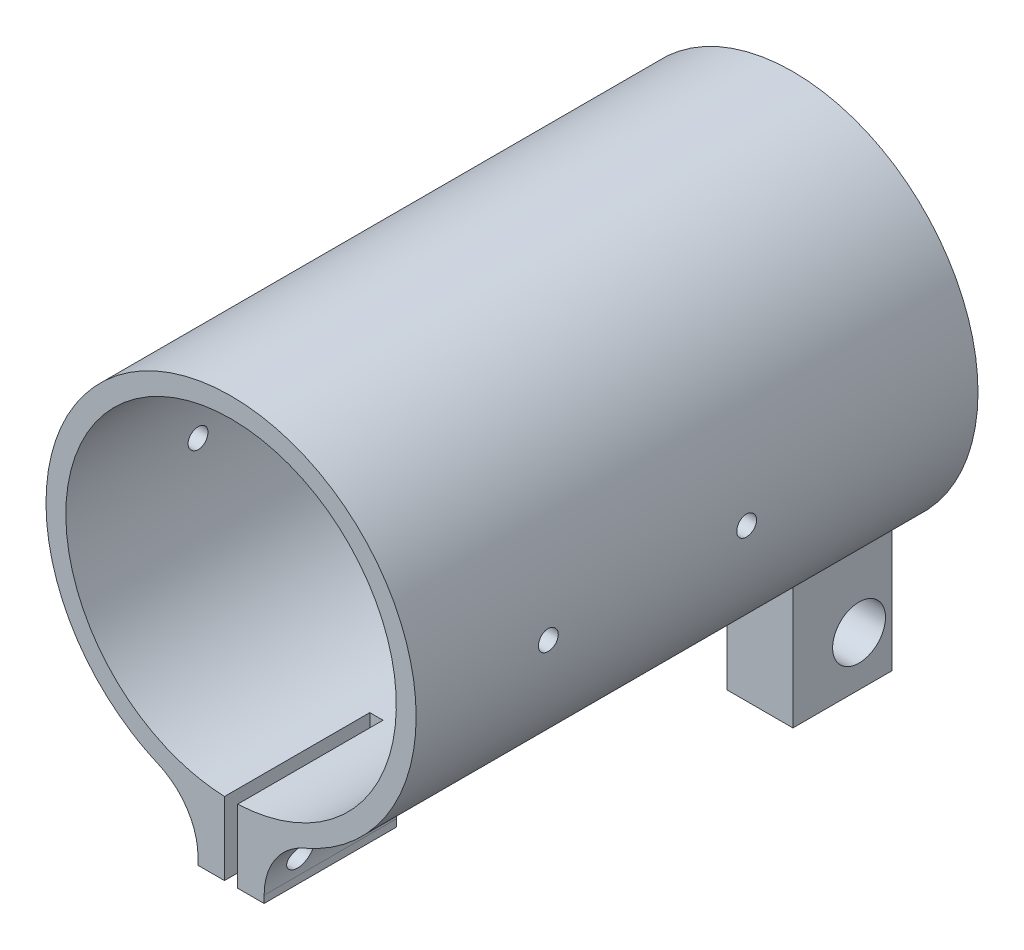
from build123d import *
from build123d.topology import SkipClean

# Parameters (mm, degrees)
SKETCH_1_R               = 28
SKETCH_1_R_2             = 25
EXTRUDE_1_DEPTH          = 75
EXTRUDE_START            = -20
EXTRUDE_3_DEPTH          = 20
FILLET_1_R               = 10
SKETCH_3_W               = 2
SKETCH_3_H               = 33.376102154
CUT_EXTRUDE_1_DEPTH      = 22
CUT_EXTRUDE_2_DEPTH      = 88.778129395
CUT_EXTRUDE_2_DEPTH_BACK = 88.778129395
SKETCH_4_R               = 2
SKETCH_4_R_2             = 1.5
SKETCH_6_W               = 15
SKETCH_6_H               = 15
SKETCH_6_R               = 4
SKETCH_6_W_2             = 5
SKETCH_6_H_2             = 5
EXTRUDE_4_DEPTH          = 15
SKETCH_6_3_W             = 15
SKETCH_6_3_H             = 15
SKETCH_6_3_R             = 4
CUT_EXTRUDE_3_DEPTH      = 5
EXTRUDE_START_2          = 10
EXTRUDE_5_DEPTH          = 10


with BuildPart() as part:
    # Sketch 1 → Extrude 1 (new body)
    with BuildSketch(Plane.XY):
        Circle(SKETCH_1_R)
        Circle(SKETCH_1_R_2, mode=Mode.SUBTRACT)
    extrude(amount=EXTRUDE_1_DEPTH)

    # Sketch 2 → Extrude 3 (add)
    with BuildSketch(Plane.XY.offset(75).offset(EXTRUDE_START)):
        with BuildLine():
            Line((5, -36), (5, -27.549954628))
            ThreePointArc((5, -27.549954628), (0, -28), (-5, -27.549954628))
            Line((-5, -27.549954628), (-5, -36))
            Line((-5, -36), (5, -36))
        make_face()
    extrude(amount=EXTRUDE_3_DEPTH)

    # Fillet 1
    fillet_1_edges = [part.edges().sort_by_distance(p)[0] for p in [
        (-5, -27.549954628, 65),
        (5, -27.549954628, 65),
    ]]
    fillet(fillet_1_edges, radius=FILLET_1_R)

    # Sketch 3 → Cut-Extrude 1 (cut)
    with BuildSketch(Plane.XY.offset(75)):
        with Locations((0, -22.764444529)):
            Rectangle(SKETCH_3_W, SKETCH_3_H)
    extrude(amount=-CUT_EXTRUDE_1_DEPTH, mode=Mode.SUBTRACT)

    # Sketch 4 → Cut-Extrude 2 (cut, two sides: drawn at the far end of the back side and taken through both)
    with BuildSketch(Plane(origin=(0, 0, 0), x_dir=(0, 0, -1), z_dir=(1, 0, 0)).offset(-CUT_EXTRUDE_2_DEPTH_BACK)):
        with Locations((-70, -31.824089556)):
            Circle(SKETCH_4_R)
        with Locations((-60.000009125, -31.837598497)):
            Circle(SKETCH_4_R)
        with Locations((-55, 0)):
            Circle(SKETCH_4_R_2)
        with Locations((-25, 0)):
            Circle(SKETCH_4_R_2)
    extrude(amount=CUT_EXTRUDE_2_DEPTH + CUT_EXTRUDE_2_DEPTH_BACK, mode=Mode.SUBTRACT)

    # Sketch 6 → Extrude 4 (add, symmetric)
    # profile 1 of 2: a face of its own
    with BuildSketch(Plane(origin=(0, 0, 0), x_dir=(0, 0, -1), z_dir=(1, 0, 0))):
        with Locations((2.5, -35.5)):
            Rectangle(SKETCH_6_W, SKETCH_6_H)
        with Locations((5, -35.5)):
            Circle(SKETCH_6_R, mode=Mode.SUBTRACT)
    # profile 2 of 2: a face of its own
    with BuildSketch(Plane(origin=(0, 0, 0), x_dir=(0, 0, -1), z_dir=(1, 0, 0))):
        with Locations((-2.5, -25.5)):
            Rectangle(SKETCH_6_W_2, SKETCH_6_H_2)
    extrude(amount=EXTRUDE_4_DEPTH, both=True)

    # Sketch 6_3 → Cut-Extrude 3 (cut, symmetric)
    with BuildSketch(Plane(origin=(0, 0, 0), x_dir=(0, 0, -1), z_dir=(1, 0, 0))):
        with Locations((2.5, -35.5)):
            Rectangle(SKETCH_6_3_W, SKETCH_6_3_H)
        with Locations((5, -35.5)):
            Circle(SKETCH_6_3_R, mode=Mode.SUBTRACT)
    extrude(amount=CUT_EXTRUDE_3_DEPTH, both=True, mode=Mode.SUBTRACT)

    # Sketch 7 → Extrude 5 (add)
    with SkipClean():  # the faces are left unmerged after this step: merging them gives an invalid solid
        with BuildSketch(Plane(origin=(0, 0, 0), x_dir=(-1, 0, 0), z_dir=(0, 0, -1)).offset(EXTRUDE_START_2)):
            with BuildLine():
                Line((-15, -23.643180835), (-15, -28))
                Line((-15, -28), (-5, -28))
                Line((-5, -28), (5, -28))
                Line((5, -28), (15, -28))
                Line((15, -28), (15, -23.643180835))
                ThreePointArc((15, -23.643180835), (0, 28), (-15, -23.643180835))
            make_face()
            with BuildLine():
                Line((-9.797958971, -23), (9.797958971, -23))
                ThreePointArc((9.797958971, -23), (0, 25), (-9.797958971, -23))
            make_face(mode=Mode.SUBTRACT)
        extrude(amount=-EXTRUDE_5_DEPTH)


solid = part.part
